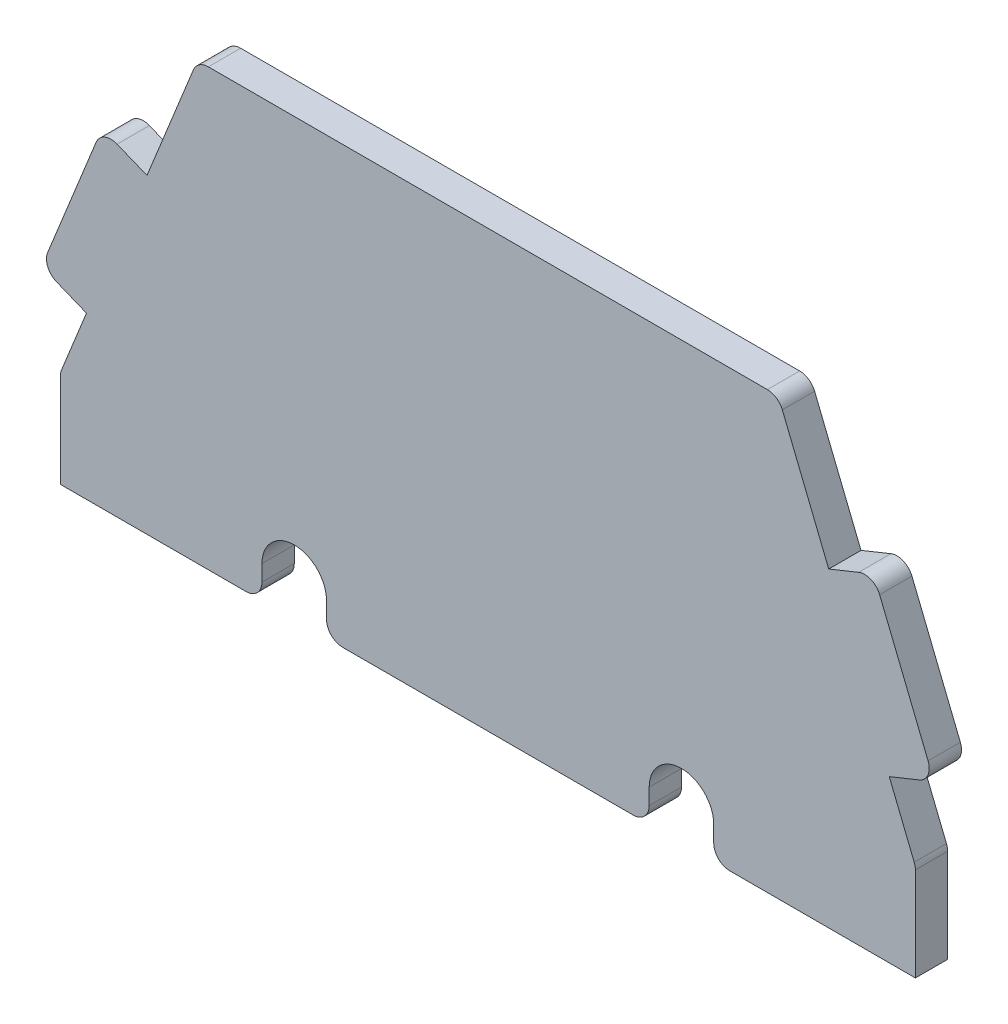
ISO-10303-21;
HEADER;
FILE_DESCRIPTION(('STEP AP214'),'2;1');
FILE_NAME('part.step','',(''),(''),'','','');
FILE_SCHEMA(('AUTOMOTIVE_DESIGN { 1 0 10303 214 1 1 1 1 }'));
ENDSEC;
DATA;
#1=APPLICATION_CONTEXT('core data for automotive mechanical design processes');
#2=APPLICATION_PROTOCOL_DEFINITION('international standard','automotive_design',2000,#1);
#3=PRODUCT_CONTEXT('',#1,'mechanical');
#4=PRODUCT('Part','Part','',(#3));
#5=PRODUCT_RELATED_PRODUCT_CATEGORY('part','',(#4));
#6=PRODUCT_DEFINITION_FORMATION('','',#4);
#7=PRODUCT_DEFINITION_CONTEXT('part definition',#1,'design');
#8=PRODUCT_DEFINITION('design','',#6,#7);
#9=PRODUCT_DEFINITION_SHAPE('','',#8);
#10=(LENGTH_UNIT() NAMED_UNIT(*) SI_UNIT(.MILLI.,.METRE.));
#11=(NAMED_UNIT(*) PLANE_ANGLE_UNIT() SI_UNIT($,.RADIAN.));
#12=(NAMED_UNIT(*) SI_UNIT($,.STERADIAN.) SOLID_ANGLE_UNIT());
#13=UNCERTAINTY_MEASURE_WITH_UNIT(LENGTH_MEASURE(1.E-05),#10,'distance_accuracy_value','');
#14=(GEOMETRIC_REPRESENTATION_CONTEXT(3) GLOBAL_UNCERTAINTY_ASSIGNED_CONTEXT((#13)) GLOBAL_UNIT_ASSIGNED_CONTEXT((#10,
#11,#12)) REPRESENTATION_CONTEXT('',''));
#15=CARTESIAN_POINT('',(0.,0.,0.));
#16=DIRECTION('',(0.,0.,1.));
#17=DIRECTION('',(1.,0.,0.));
#18=AXIS2_PLACEMENT_3D('',#15,#16,#17);
#19=CARTESIAN_POINT('',(15.,-13.5,2.));
#20=DIRECTION('',(0.,1.,0.));
#21=DIRECTION('',(-1.,0.,0.));
#22=AXIS2_PLACEMENT_3D('',#19,#20,#21);
#23=PLANE('',#22);
#24=DIRECTION('',(1.,0.,0.));
#25=VECTOR('',#24,1.);
#26=CARTESIAN_POINT('',(15.,-13.5,0.));
#27=LINE('',#26,#25);
#28=CARTESIAN_POINT('',(15.,-13.5,0.));
#29=VERTEX_POINT('',#28);
#30=CARTESIAN_POINT('',(26.5,-13.5,0.));
#31=VERTEX_POINT('',#30);
#32=EDGE_CURVE('E284',#29,#31,#27,.T.);
#33=ORIENTED_EDGE('',*,*,#32,.T.);
#34=DIRECTION('',(0.,0.,-1.));
#35=VECTOR('',#34,1.);
#36=CARTESIAN_POINT('',(26.5,-13.5,2.));
#37=LINE('',#36,#35);
#38=CARTESIAN_POINT('',(26.5,-13.5,2.));
#39=VERTEX_POINT('',#38);
#40=EDGE_CURVE('E11',#39,#31,#37,.T.);
#41=ORIENTED_EDGE('',*,*,#40,.F.);
#42=DIRECTION('',(1.,0.,0.));
#43=VECTOR('',#42,1.);
#44=CARTESIAN_POINT('',(15.,-13.5,2.));
#45=LINE('',#44,#43);
#46=CARTESIAN_POINT('',(15.,-13.5,2.));
#47=VERTEX_POINT('',#46);
#48=EDGE_CURVE('E350',#47,#39,#45,.T.);
#49=ORIENTED_EDGE('',*,*,#48,.F.);
#50=DIRECTION('',(0.,0.,-1.));
#51=VECTOR('',#50,1.);
#52=CARTESIAN_POINT('',(15.,-13.5,2.));
#53=LINE('',#52,#51);
#54=EDGE_CURVE('E280',#47,#29,#53,.T.);
#55=ORIENTED_EDGE('',*,*,#54,.T.);
#56=EDGE_LOOP('',(#33,#41,#49,#55));
#57=FACE_BOUND('',#56,.T.);
#58=ADVANCED_FACE('F32',(#57),#23,.F.);
#59=CARTESIAN_POINT('',(26.5,-7.69470841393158,2.));
#60=DIRECTION('',(-1.,0.,0.));
#61=DIRECTION('',(0.,-1.,0.));
#62=AXIS2_PLACEMENT_3D('',#59,#60,#61);
#63=PLANE('',#62);
#64=DIRECTION('',(0.,1.,0.));
#65=VECTOR('',#64,1.);
#66=CARTESIAN_POINT('',(26.5,-7.69470841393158,0.));
#67=LINE('',#66,#65);
#68=CARTESIAN_POINT('',(26.5,-7.69470841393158,0.));
#69=VERTEX_POINT('',#68);
#70=EDGE_CURVE('E287',#31,#69,#67,.T.);
#71=ORIENTED_EDGE('',*,*,#70,.T.);
#72=DIRECTION('',(0.,0.,-1.));
#73=VECTOR('',#72,1.);
#74=CARTESIAN_POINT('',(26.5,-7.69470841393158,2.));
#75=LINE('',#74,#73);
#76=CARTESIAN_POINT('',(26.5,-7.69470841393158,2.));
#77=VERTEX_POINT('',#76);
#78=EDGE_CURVE('E40',#77,#69,#75,.T.);
#79=ORIENTED_EDGE('',*,*,#78,.F.);
#80=DIRECTION('',(0.,1.,0.));
#81=VECTOR('',#80,1.);
#82=CARTESIAN_POINT('',(26.5,-7.69470841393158,2.));
#83=LINE('',#82,#81);
#84=EDGE_CURVE('E169',#39,#77,#83,.T.);
#85=ORIENTED_EDGE('',*,*,#84,.F.);
#86=ORIENTED_EDGE('',*,*,#40,.T.);
#87=EDGE_LOOP('',(#71,#79,#85,#86));
#88=FACE_BOUND('',#87,.T.);
#89=ADVANCED_FACE('F538',(#88),#63,.F.);
#90=CARTESIAN_POINT('',(25.5,-7.69470841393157,2.));
#91=DIRECTION('',(0.,0.,-1.));
#92=DIRECTION('',(-1.,0.,0.));
#93=AXIS2_PLACEMENT_3D('',#90,#91,#92);
#94=CYLINDRICAL_SURFACE('',#93,1.);
#95=CARTESIAN_POINT('',(25.5,-7.69470841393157,0.));
#96=DIRECTION('',(0.,0.,1.));
#97=DIRECTION('',(-1.,0.,0.));
#98=AXIS2_PLACEMENT_3D('',#95,#96,#97);
#99=CIRCLE('',#98,1.);
#100=CARTESIAN_POINT('',(26.4269468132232,-7.3195156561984,0.));
#101=VERTEX_POINT('',#100);
#102=EDGE_CURVE('E289',#69,#101,#99,.T.);
#103=ORIENTED_EDGE('',*,*,#102,.T.);
#104=DIRECTION('',(0.,0.,-1.));
#105=VECTOR('',#104,1.);
#106=CARTESIAN_POINT('',(26.4269468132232,-7.3195156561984,2.));
#107=LINE('',#106,#105);
#108=CARTESIAN_POINT('',(26.4269468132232,-7.3195156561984,2.));
#109=VERTEX_POINT('',#108);
#110=EDGE_CURVE('E435',#109,#101,#107,.T.);
#111=ORIENTED_EDGE('',*,*,#110,.F.);
#112=CARTESIAN_POINT('',(25.5,-7.69470841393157,2.));
#113=DIRECTION('',(0.,0.,1.));
#114=DIRECTION('',(-1.,0.,0.));
#115=AXIS2_PLACEMENT_3D('',#112,#113,#114);
#116=CIRCLE('',#115,1.);
#117=EDGE_CURVE('E443',#77,#109,#116,.T.);
#118=ORIENTED_EDGE('',*,*,#117,.F.);
#119=ORIENTED_EDGE('',*,*,#78,.T.);
#120=EDGE_LOOP('',(#103,#111,#118,#119));
#121=FACE_BOUND('',#120,.T.);
#122=ADVANCED_FACE('F441',(#121),#94,.T.);
#123=CARTESIAN_POINT('',(26.4269468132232,-7.3195156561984,2.));
#124=DIRECTION('',(-0.926946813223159,-0.375192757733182,0.));
#125=DIRECTION('',(0.375192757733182,-0.926946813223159,0.));
#126=AXIS2_PLACEMENT_3D('',#123,#124,#125);
#127=PLANE('',#126);
#128=DIRECTION('',(-0.375192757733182,0.926946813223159,0.));
#129=VECTOR('',#128,1.);
#130=CARTESIAN_POINT('',(26.4269468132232,-7.3195156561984,0.));
#131=LINE('',#130,#129);
#132=CARTESIAN_POINT('',(24.8809523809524,-3.5,0.));
#133=VERTEX_POINT('',#132);
#134=EDGE_CURVE('E291',#101,#133,#131,.T.);
#135=ORIENTED_EDGE('',*,*,#134,.T.);
#136=DIRECTION('',(0.,0.,-1.));
#137=VECTOR('',#136,1.);
#138=CARTESIAN_POINT('',(24.8809523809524,-3.5,2.));
#139=LINE('',#138,#137);
#140=CARTESIAN_POINT('',(24.8809523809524,-3.5,2.));
#141=VERTEX_POINT('',#140);
#142=EDGE_CURVE('E432',#141,#133,#139,.T.);
#143=ORIENTED_EDGE('',*,*,#142,.F.);
#144=DIRECTION('',(-0.375192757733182,0.926946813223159,0.));
#145=VECTOR('',#144,1.);
#146=CARTESIAN_POINT('',(26.4269468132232,-7.3195156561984,2.));
#147=LINE('',#146,#145);
#148=EDGE_CURVE('E461',#109,#141,#147,.T.);
#149=ORIENTED_EDGE('',*,*,#148,.F.);
#150=ORIENTED_EDGE('',*,*,#110,.T.);
#151=EDGE_LOOP('',(#135,#143,#149,#150));
#152=FACE_BOUND('',#151,.T.);
#153=ADVANCED_FACE('F452',(#152),#127,.F.);
#154=CARTESIAN_POINT('',(24.8809523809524,-3.5,2.));
#155=DIRECTION('',(-0.375192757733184,0.926946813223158,0.));
#156=DIRECTION('',(-0.926946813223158,-0.375192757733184,0.));
#157=AXIS2_PLACEMENT_3D('',#154,#155,#156);
#158=PLANE('',#157);
#159=DIRECTION('',(0.926946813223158,0.375192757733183,0.));
#160=VECTOR('',#159,1.);
#161=CARTESIAN_POINT('',(24.8809523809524,-3.5,0.));
#162=LINE('',#161,#160);
#163=CARTESIAN_POINT('',(26.7348460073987,-2.74961448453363,0.));
#164=VERTEX_POINT('',#163);
#165=EDGE_CURVE('E293',#133,#164,#162,.T.);
#166=ORIENTED_EDGE('',*,*,#165,.T.);
#167=DIRECTION('',(0.,0.,-1.));
#168=VECTOR('',#167,1.);
#169=CARTESIAN_POINT('',(26.7348460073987,-2.74961448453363,2.));
#170=LINE('',#169,#168);
#171=CARTESIAN_POINT('',(26.7348460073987,-2.74961448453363,2.));
#172=VERTEX_POINT('',#171);
#173=EDGE_CURVE('E429',#172,#164,#170,.T.);
#174=ORIENTED_EDGE('',*,*,#173,.F.);
#175=DIRECTION('',(0.926946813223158,0.375192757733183,0.));
#176=VECTOR('',#175,1.);
#177=CARTESIAN_POINT('',(24.8809523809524,-3.5,2.));
#178=LINE('',#177,#176);
#179=EDGE_CURVE('E458',#141,#172,#178,.T.);
#180=ORIENTED_EDGE('',*,*,#179,.F.);
#181=ORIENTED_EDGE('',*,*,#142,.T.);
#182=EDGE_LOOP('',(#166,#174,#180,#181));
#183=FACE_BOUND('',#182,.T.);
#184=ADVANCED_FACE('F456',(#183),#158,.F.);
#185=CARTESIAN_POINT('',(26.3596532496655,-1.82266767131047,2.));
#186=DIRECTION('',(0.,0.,-1.));
#187=DIRECTION('',(-1.,0.,0.));
#188=AXIS2_PLACEMENT_3D('',#185,#186,#187);
#189=CYLINDRICAL_SURFACE('',#188,0.999999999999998);
#190=CARTESIAN_POINT('',(26.3596532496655,-1.82266767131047,0.));
#191=DIRECTION('',(0.,0.,1.));
#192=DIRECTION('',(1.,0.,0.));
#193=AXIS2_PLACEMENT_3D('',#190,#191,#192);
#194=CIRCLE('',#193,0.999999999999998);
#195=CARTESIAN_POINT('',(27.2866000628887,-1.44747491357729,0.));
#196=VERTEX_POINT('',#195);
#197=EDGE_CURVE('E295',#164,#196,#194,.T.);
#198=ORIENTED_EDGE('',*,*,#197,.T.);
#199=DIRECTION('',(0.,0.,-1.));
#200=VECTOR('',#199,1.);
#201=CARTESIAN_POINT('',(27.2866000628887,-1.44747491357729,2.));
#202=LINE('',#201,#200);
#203=CARTESIAN_POINT('',(27.2866000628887,-1.44747491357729,2.));
#204=VERTEX_POINT('',#203);
#205=EDGE_CURVE('E426',#204,#196,#202,.T.);
#206=ORIENTED_EDGE('',*,*,#205,.F.);
#207=CARTESIAN_POINT('',(26.3596532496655,-1.82266767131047,2.));
#208=DIRECTION('',(0.,0.,1.));
#209=DIRECTION('',(1.,0.,0.));
#210=AXIS2_PLACEMENT_3D('',#207,#208,#209);
#211=CIRCLE('',#210,0.999999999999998);
#212=EDGE_CURVE('E460',#172,#204,#211,.T.);
#213=ORIENTED_EDGE('',*,*,#212,.F.);
#214=ORIENTED_EDGE('',*,*,#173,.T.);
#215=EDGE_LOOP('',(#198,#206,#213,#214));
#216=FACE_BOUND('',#215,.T.);
#217=ADVANCED_FACE('F551',(#216),#189,.T.);
#218=CARTESIAN_POINT('',(27.2866000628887,-1.44747491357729,2.));
#219=DIRECTION('',(-0.926946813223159,-0.375192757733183,0.));
#220=DIRECTION('',(0.375192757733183,-0.926946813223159,0.));
#221=AXIS2_PLACEMENT_3D('',#218,#219,#220);
#222=PLANE('',#221);
#223=DIRECTION('',(-0.375192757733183,0.926946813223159,0.));
#224=VECTOR('',#223,1.);
#225=CARTESIAN_POINT('',(27.2866000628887,-1.44747491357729,0.));
#226=LINE('',#225,#224);
#227=CARTESIAN_POINT('',(24.2850580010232,5.96809959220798,0.));
#228=VERTEX_POINT('',#227);
#229=EDGE_CURVE('E297',#196,#228,#226,.T.);
#230=ORIENTED_EDGE('',*,*,#229,.T.);
#231=DIRECTION('',(0.,0.,-1.));
#232=VECTOR('',#231,1.);
#233=CARTESIAN_POINT('',(24.2850580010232,5.96809959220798,2.));
#234=LINE('',#233,#232);
#235=CARTESIAN_POINT('',(24.2850580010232,5.96809959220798,2.));
#236=VERTEX_POINT('',#235);
#237=EDGE_CURVE('E423',#236,#228,#234,.T.);
#238=ORIENTED_EDGE('',*,*,#237,.F.);
#239=DIRECTION('',(-0.375192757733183,0.926946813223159,0.));
#240=VECTOR('',#239,1.);
#241=CARTESIAN_POINT('',(27.2866000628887,-1.44747491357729,2.));
#242=LINE('',#241,#240);
#243=EDGE_CURVE('E463',#204,#236,#242,.T.);
#244=ORIENTED_EDGE('',*,*,#243,.F.);
#245=ORIENTED_EDGE('',*,*,#205,.T.);
#246=EDGE_LOOP('',(#230,#238,#244,#245));
#247=FACE_BOUND('',#246,.T.);
#248=ADVANCED_FACE('F554',(#247),#222,.F.);
#249=CARTESIAN_POINT('',(23.3581111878,5.5929068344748,2.));
#250=DIRECTION('',(0.,0.,-1.));
#251=DIRECTION('',(-1.,0.,0.));
#252=AXIS2_PLACEMENT_3D('',#249,#250,#251);
#253=CYLINDRICAL_SURFACE('',#252,1.);
#254=CARTESIAN_POINT('',(23.3581111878,5.5929068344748,0.));
#255=DIRECTION('',(0.,0.,1.));
#256=DIRECTION('',(-1.,0.,0.));
#257=AXIS2_PLACEMENT_3D('',#254,#255,#256);
#258=CIRCLE('',#257,1.);
#259=CARTESIAN_POINT('',(22.9829184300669,6.51985364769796,0.));
#260=VERTEX_POINT('',#259);
#261=EDGE_CURVE('E299',#228,#260,#258,.T.);
#262=ORIENTED_EDGE('',*,*,#261,.T.);
#263=DIRECTION('',(0.,0.,-1.));
#264=VECTOR('',#263,1.);
#265=CARTESIAN_POINT('',(22.9829184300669,6.51985364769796,2.));
#266=LINE('',#265,#264);
#267=CARTESIAN_POINT('',(22.9829184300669,6.51985364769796,2.));
#268=VERTEX_POINT('',#267);
#269=EDGE_CURVE('E420',#268,#260,#266,.T.);
#270=ORIENTED_EDGE('',*,*,#269,.F.);
#271=CARTESIAN_POINT('',(23.3581111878,5.5929068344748,2.));
#272=DIRECTION('',(0.,0.,1.));
#273=DIRECTION('',(-1.,0.,0.));
#274=AXIS2_PLACEMENT_3D('',#271,#272,#273);
#275=CIRCLE('',#274,1.);
#276=EDGE_CURVE('E469',#236,#268,#275,.T.);
#277=ORIENTED_EDGE('',*,*,#276,.F.);
#278=ORIENTED_EDGE('',*,*,#237,.T.);
#279=EDGE_LOOP('',(#262,#270,#277,#278));
#280=FACE_BOUND('',#279,.T.);
#281=ADVANCED_FACE('F558',(#280),#253,.T.);
#282=CARTESIAN_POINT('',(21.1290248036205,5.76946813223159,2.));
#283=DIRECTION('',(0.375192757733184,-0.926946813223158,0.));
#284=DIRECTION('',(0.926946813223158,0.375192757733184,0.));
#285=AXIS2_PLACEMENT_3D('',#282,#283,#284);
#286=PLANE('',#285);
#287=DIRECTION('',(-0.926946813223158,-0.375192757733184,0.));
#288=VECTOR('',#287,1.);
#289=CARTESIAN_POINT('',(21.1290248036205,5.76946813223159,0.));
#290=LINE('',#289,#288);
#291=CARTESIAN_POINT('',(21.1290248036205,5.76946813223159,0.));
#292=VERTEX_POINT('',#291);
#293=EDGE_CURVE('E301',#260,#292,#290,.T.);
#294=ORIENTED_EDGE('',*,*,#293,.T.);
#295=DIRECTION('',(0.,0.,-1.));
#296=VECTOR('',#295,1.);
#297=CARTESIAN_POINT('',(21.1290248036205,5.76946813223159,2.));
#298=LINE('',#297,#296);
#299=CARTESIAN_POINT('',(21.1290248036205,5.76946813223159,2.));
#300=VERTEX_POINT('',#299);
#301=EDGE_CURVE('E417',#300,#292,#298,.T.);
#302=ORIENTED_EDGE('',*,*,#301,.F.);
#303=DIRECTION('',(-0.926946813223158,-0.375192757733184,0.));
#304=VECTOR('',#303,1.);
#305=CARTESIAN_POINT('',(21.1290248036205,5.76946813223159,2.));
#306=LINE('',#305,#304);
#307=EDGE_CURVE('E471',#268,#300,#306,.T.);
#308=ORIENTED_EDGE('',*,*,#307,.F.);
#309=ORIENTED_EDGE('',*,*,#269,.T.);
#310=EDGE_LOOP('',(#294,#302,#308,#309));
#311=FACE_BOUND('',#310,.T.);
#312=ADVANCED_FACE('F562',(#311),#286,.F.);
#313=CARTESIAN_POINT('',(21.1290248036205,5.76946813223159,2.));
#314=DIRECTION('',(-0.926946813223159,-0.375192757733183,0.));
#315=DIRECTION('',(0.375192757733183,-0.926946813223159,0.));
#316=AXIS2_PLACEMENT_3D('',#313,#314,#315);
#317=PLANE('',#316);
#318=DIRECTION('',(-0.375192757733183,0.926946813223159,0.));
#319=VECTOR('',#318,1.);
#320=CARTESIAN_POINT('',(21.1290248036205,5.76946813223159,0.));
#321=LINE('',#320,#319);
#322=CARTESIAN_POINT('',(18.252898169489,12.8751927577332,0.));
#323=VERTEX_POINT('',#322);
#324=EDGE_CURVE('E303',#292,#323,#321,.T.);
#325=ORIENTED_EDGE('',*,*,#324,.T.);
#326=DIRECTION('',(0.,0.,-1.));
#327=VECTOR('',#326,1.);
#328=CARTESIAN_POINT('',(18.252898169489,12.8751927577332,2.));
#329=LINE('',#328,#327);
#330=CARTESIAN_POINT('',(18.252898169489,12.8751927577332,2.));
#331=VERTEX_POINT('',#330);
#332=EDGE_CURVE('E414',#331,#323,#329,.T.);
#333=ORIENTED_EDGE('',*,*,#332,.F.);
#334=DIRECTION('',(-0.375192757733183,0.926946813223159,0.));
#335=VECTOR('',#334,1.);
#336=CARTESIAN_POINT('',(21.1290248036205,5.76946813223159,2.));
#337=LINE('',#336,#335);
#338=EDGE_CURVE('E473',#300,#331,#337,.T.);
#339=ORIENTED_EDGE('',*,*,#338,.F.);
#340=ORIENTED_EDGE('',*,*,#301,.T.);
#341=EDGE_LOOP('',(#325,#333,#339,#340));
#342=FACE_BOUND('',#341,.T.);
#343=ADVANCED_FACE('F566',(#342),#317,.F.);
#344=CARTESIAN_POINT('',(17.3259513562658,12.5,2.));
#345=DIRECTION('',(0.,0.,-1.));
#346=DIRECTION('',(-1.,0.,0.));
#347=AXIS2_PLACEMENT_3D('',#344,#345,#346);
#348=CYLINDRICAL_SURFACE('',#347,0.999999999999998);
#349=CARTESIAN_POINT('',(17.3259513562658,12.5,0.));
#350=DIRECTION('',(0.,0.,1.));
#351=DIRECTION('',(1.,0.,0.));
#352=AXIS2_PLACEMENT_3D('',#349,#350,#351);
#353=CIRCLE('',#352,0.999999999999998);
#354=CARTESIAN_POINT('',(17.3259513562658,13.5,0.));
#355=VERTEX_POINT('',#354);
#356=EDGE_CURVE('E305',#323,#355,#353,.T.);
#357=ORIENTED_EDGE('',*,*,#356,.T.);
#358=DIRECTION('',(0.,0.,-1.));
#359=VECTOR('',#358,1.);
#360=CARTESIAN_POINT('',(17.3259513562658,13.5,2.));
#361=LINE('',#360,#359);
#362=CARTESIAN_POINT('',(17.3259513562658,13.5,2.));
#363=VERTEX_POINT('',#362);
#364=EDGE_CURVE('E411',#363,#355,#361,.T.);
#365=ORIENTED_EDGE('',*,*,#364,.F.);
#366=CARTESIAN_POINT('',(17.3259513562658,12.5,2.));
#367=DIRECTION('',(0.,0.,1.));
#368=DIRECTION('',(1.,0.,0.));
#369=AXIS2_PLACEMENT_3D('',#366,#367,#368);
#370=CIRCLE('',#369,0.999999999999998);
#371=EDGE_CURVE('E475',#331,#363,#370,.T.);
#372=ORIENTED_EDGE('',*,*,#371,.F.);
#373=ORIENTED_EDGE('',*,*,#332,.T.);
#374=EDGE_LOOP('',(#357,#365,#372,#373));
#375=FACE_BOUND('',#374,.T.);
#376=ADVANCED_FACE('F570',(#375),#348,.T.);
#377=CARTESIAN_POINT('',(-17.3259513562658,13.5,2.));
#378=DIRECTION('',(0.,-1.,0.));
#379=DIRECTION('',(1.,0.,0.));
#380=AXIS2_PLACEMENT_3D('',#377,#378,#379);
#381=PLANE('',#380);
#382=DIRECTION('',(-1.,0.,0.));
#383=VECTOR('',#382,1.);
#384=CARTESIAN_POINT('',(-17.3259513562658,13.5,0.));
#385=LINE('',#384,#383);
#386=CARTESIAN_POINT('',(-17.3259513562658,13.5,0.));
#387=VERTEX_POINT('',#386);
#388=EDGE_CURVE('E307',#355,#387,#385,.T.);
#389=ORIENTED_EDGE('',*,*,#388,.T.);
#390=DIRECTION('',(0.,0.,-1.));
#391=VECTOR('',#390,1.);
#392=CARTESIAN_POINT('',(-17.3259513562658,13.5,2.));
#393=LINE('',#392,#391);
#394=CARTESIAN_POINT('',(-17.3259513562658,13.5,2.));
#395=VERTEX_POINT('',#394);
#396=EDGE_CURVE('E408',#395,#387,#393,.T.);
#397=ORIENTED_EDGE('',*,*,#396,.F.);
#398=DIRECTION('',(-1.,0.,0.));
#399=VECTOR('',#398,1.);
#400=CARTESIAN_POINT('',(-17.3259513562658,13.5,2.));
#401=LINE('',#400,#399);
#402=EDGE_CURVE('E477',#363,#395,#401,.T.);
#403=ORIENTED_EDGE('',*,*,#402,.F.);
#404=ORIENTED_EDGE('',*,*,#364,.T.);
#405=EDGE_LOOP('',(#389,#397,#403,#404));
#406=FACE_BOUND('',#405,.T.);
#407=ADVANCED_FACE('F574',(#406),#381,.F.);
#408=CARTESIAN_POINT('',(-17.3259513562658,12.5,2.));
#409=DIRECTION('',(0.,0.,-1.));
#410=DIRECTION('',(-1.,0.,0.));
#411=AXIS2_PLACEMENT_3D('',#408,#409,#410);
#412=CYLINDRICAL_SURFACE('',#411,0.999999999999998);
#413=CARTESIAN_POINT('',(-17.3259513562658,12.5,0.));
#414=DIRECTION('',(0.,0.,1.));
#415=DIRECTION('',(-1.,0.,0.));
#416=AXIS2_PLACEMENT_3D('',#413,#414,#415);
#417=CIRCLE('',#416,0.999999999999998);
#418=CARTESIAN_POINT('',(-18.252898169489,12.8751927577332,0.));
#419=VERTEX_POINT('',#418);
#420=EDGE_CURVE('E309',#387,#419,#417,.T.);
#421=ORIENTED_EDGE('',*,*,#420,.T.);
#422=DIRECTION('',(0.,0.,-1.));
#423=VECTOR('',#422,1.);
#424=CARTESIAN_POINT('',(-18.252898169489,12.8751927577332,2.));
#425=LINE('',#424,#423);
#426=CARTESIAN_POINT('',(-18.252898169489,12.8751927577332,2.));
#427=VERTEX_POINT('',#426);
#428=EDGE_CURVE('E405',#427,#419,#425,.T.);
#429=ORIENTED_EDGE('',*,*,#428,.F.);
#430=CARTESIAN_POINT('',(-17.3259513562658,12.5,2.));
#431=DIRECTION('',(0.,0.,1.));
#432=DIRECTION('',(-1.,0.,0.));
#433=AXIS2_PLACEMENT_3D('',#430,#431,#432);
#434=CIRCLE('',#433,0.999999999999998);
#435=EDGE_CURVE('E479',#395,#427,#434,.T.);
#436=ORIENTED_EDGE('',*,*,#435,.F.);
#437=ORIENTED_EDGE('',*,*,#396,.T.);
#438=EDGE_LOOP('',(#421,#429,#436,#437));
#439=FACE_BOUND('',#438,.T.);
#440=ADVANCED_FACE('F578',(#439),#412,.T.);
#441=CARTESIAN_POINT('',(-21.1290248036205,5.76946813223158,2.));
#442=DIRECTION('',(0.926946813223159,-0.375192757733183,0.));
#443=DIRECTION('',(0.375192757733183,0.926946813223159,0.));
#444=AXIS2_PLACEMENT_3D('',#441,#442,#443);
#445=PLANE('',#444);
#446=DIRECTION('',(-0.375192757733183,-0.926946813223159,0.));
#447=VECTOR('',#446,1.);
#448=CARTESIAN_POINT('',(-21.1290248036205,5.76946813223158,0.));
#449=LINE('',#448,#447);
#450=CARTESIAN_POINT('',(-21.1290248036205,5.76946813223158,0.));
#451=VERTEX_POINT('',#450);
#452=EDGE_CURVE('E311',#419,#451,#449,.T.);
#453=ORIENTED_EDGE('',*,*,#452,.T.);
#454=DIRECTION('',(0.,0.,-1.));
#455=VECTOR('',#454,1.);
#456=CARTESIAN_POINT('',(-21.1290248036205,5.76946813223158,2.));
#457=LINE('',#456,#455);
#458=CARTESIAN_POINT('',(-21.1290248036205,5.76946813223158,2.));
#459=VERTEX_POINT('',#458);
#460=EDGE_CURVE('E402',#459,#451,#457,.T.);
#461=ORIENTED_EDGE('',*,*,#460,.F.);
#462=DIRECTION('',(-0.375192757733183,-0.926946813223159,0.));
#463=VECTOR('',#462,1.);
#464=CARTESIAN_POINT('',(-21.1290248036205,5.76946813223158,2.));
#465=LINE('',#464,#463);
#466=EDGE_CURVE('E481',#427,#459,#465,.T.);
#467=ORIENTED_EDGE('',*,*,#466,.F.);
#468=ORIENTED_EDGE('',*,*,#428,.T.);
#469=EDGE_LOOP('',(#453,#461,#467,#468));
#470=FACE_BOUND('',#469,.T.);
#471=ADVANCED_FACE('F582',(#470),#445,.F.);
#472=CARTESIAN_POINT('',(-21.1290248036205,5.76946813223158,2.));
#473=DIRECTION('',(-0.375192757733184,-0.926946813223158,0.));
#474=DIRECTION('',(0.926946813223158,-0.375192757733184,0.));
#475=AXIS2_PLACEMENT_3D('',#472,#473,#474);
#476=PLANE('',#475);
#477=DIRECTION('',(-0.926946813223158,0.375192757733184,0.));
#478=VECTOR('',#477,1.);
#479=CARTESIAN_POINT('',(-21.1290248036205,5.76946813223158,0.));
#480=LINE('',#479,#478);
#481=CARTESIAN_POINT('',(-22.9829184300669,6.51985364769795,0.));
#482=VERTEX_POINT('',#481);
#483=EDGE_CURVE('E313',#451,#482,#480,.T.);
#484=ORIENTED_EDGE('',*,*,#483,.T.);
#485=DIRECTION('',(0.,0.,-1.));
#486=VECTOR('',#485,1.);
#487=CARTESIAN_POINT('',(-22.9829184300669,6.51985364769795,2.));
#488=LINE('',#487,#486);
#489=CARTESIAN_POINT('',(-22.9829184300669,6.51985364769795,2.));
#490=VERTEX_POINT('',#489);
#491=EDGE_CURVE('E399',#490,#482,#488,.T.);
#492=ORIENTED_EDGE('',*,*,#491,.F.);
#493=DIRECTION('',(-0.926946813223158,0.375192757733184,0.));
#494=VECTOR('',#493,1.);
#495=CARTESIAN_POINT('',(-21.1290248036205,5.76946813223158,2.));
#496=LINE('',#495,#494);
#497=EDGE_CURVE('E483',#459,#490,#496,.T.);
#498=ORIENTED_EDGE('',*,*,#497,.F.);
#499=ORIENTED_EDGE('',*,*,#460,.T.);
#500=EDGE_LOOP('',(#484,#492,#498,#499));
#501=FACE_BOUND('',#500,.T.);
#502=ADVANCED_FACE('F586',(#501),#476,.F.);
#503=CARTESIAN_POINT('',(-23.3581111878,5.59290683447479,2.));
#504=DIRECTION('',(0.,0.,-1.));
#505=DIRECTION('',(-1.,0.,0.));
#506=AXIS2_PLACEMENT_3D('',#503,#504,#505);
#507=CYLINDRICAL_SURFACE('',#506,1.);
#508=CARTESIAN_POINT('',(-23.3581111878,5.59290683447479,0.));
#509=DIRECTION('',(0.,0.,1.));
#510=DIRECTION('',(1.,0.,0.));
#511=AXIS2_PLACEMENT_3D('',#508,#509,#510);
#512=CIRCLE('',#511,1.);
#513=CARTESIAN_POINT('',(-24.2850580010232,5.96809959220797,0.));
#514=VERTEX_POINT('',#513);
#515=EDGE_CURVE('E315',#482,#514,#512,.T.);
#516=ORIENTED_EDGE('',*,*,#515,.T.);
#517=DIRECTION('',(0.,0.,-1.));
#518=VECTOR('',#517,1.);
#519=CARTESIAN_POINT('',(-24.2850580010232,5.96809959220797,2.));
#520=LINE('',#519,#518);
#521=CARTESIAN_POINT('',(-24.2850580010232,5.96809959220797,2.));
#522=VERTEX_POINT('',#521);
#523=EDGE_CURVE('E396',#522,#514,#520,.T.);
#524=ORIENTED_EDGE('',*,*,#523,.F.);
#525=CARTESIAN_POINT('',(-23.3581111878,5.59290683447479,2.));
#526=DIRECTION('',(0.,0.,1.));
#527=DIRECTION('',(1.,0.,0.));
#528=AXIS2_PLACEMENT_3D('',#525,#526,#527);
#529=CIRCLE('',#528,1.);
#530=EDGE_CURVE('E485',#490,#522,#529,.T.);
#531=ORIENTED_EDGE('',*,*,#530,.F.);
#532=ORIENTED_EDGE('',*,*,#491,.T.);
#533=EDGE_LOOP('',(#516,#524,#531,#532));
#534=FACE_BOUND('',#533,.T.);
#535=ADVANCED_FACE('F590',(#534),#507,.T.);
#536=CARTESIAN_POINT('',(-27.2866000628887,-1.4474749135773,2.));
#537=DIRECTION('',(0.926946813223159,-0.375192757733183,0.));
#538=DIRECTION('',(0.375192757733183,0.926946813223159,0.));
#539=AXIS2_PLACEMENT_3D('',#536,#537,#538);
#540=PLANE('',#539);
#541=DIRECTION('',(-0.375192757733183,-0.926946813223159,0.));
#542=VECTOR('',#541,1.);
#543=CARTESIAN_POINT('',(-27.2866000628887,-1.4474749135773,0.));
#544=LINE('',#543,#542);
#545=CARTESIAN_POINT('',(-27.2866000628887,-1.4474749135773,0.));
#546=VERTEX_POINT('',#545);
#547=EDGE_CURVE('E317',#514,#546,#544,.T.);
#548=ORIENTED_EDGE('',*,*,#547,.T.);
#549=DIRECTION('',(0.,0.,-1.));
#550=VECTOR('',#549,1.);
#551=CARTESIAN_POINT('',(-27.2866000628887,-1.4474749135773,2.));
#552=LINE('',#551,#550);
#553=CARTESIAN_POINT('',(-27.2866000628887,-1.4474749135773,2.));
#554=VERTEX_POINT('',#553);
#555=EDGE_CURVE('E393',#554,#546,#552,.T.);
#556=ORIENTED_EDGE('',*,*,#555,.F.);
#557=DIRECTION('',(-0.375192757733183,-0.926946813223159,0.));
#558=VECTOR('',#557,1.);
#559=CARTESIAN_POINT('',(-27.2866000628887,-1.4474749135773,2.));
#560=LINE('',#559,#558);
#561=EDGE_CURVE('E487',#522,#554,#560,.T.);
#562=ORIENTED_EDGE('',*,*,#561,.F.);
#563=ORIENTED_EDGE('',*,*,#523,.T.);
#564=EDGE_LOOP('',(#548,#556,#562,#563));
#565=FACE_BOUND('',#564,.T.);
#566=ADVANCED_FACE('F594',(#565),#540,.F.);
#567=CARTESIAN_POINT('',(-26.3596532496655,-1.82266767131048,2.));
#568=DIRECTION('',(0.,0.,-1.));
#569=DIRECTION('',(-1.,0.,0.));
#570=AXIS2_PLACEMENT_3D('',#567,#568,#569);
#571=CYLINDRICAL_SURFACE('',#570,0.999999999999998);
#572=CARTESIAN_POINT('',(-26.3596532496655,-1.82266767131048,0.));
#573=DIRECTION('',(0.,0.,1.));
#574=DIRECTION('',(-1.,0.,0.));
#575=AXIS2_PLACEMENT_3D('',#572,#573,#574);
#576=CIRCLE('',#575,0.999999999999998);
#577=CARTESIAN_POINT('',(-26.7348460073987,-2.74961448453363,0.));
#578=VERTEX_POINT('',#577);
#579=EDGE_CURVE('E319',#546,#578,#576,.T.);
#580=ORIENTED_EDGE('',*,*,#579,.T.);
#581=DIRECTION('',(0.,0.,-1.));
#582=VECTOR('',#581,1.);
#583=CARTESIAN_POINT('',(-26.7348460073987,-2.74961448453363,2.));
#584=LINE('',#583,#582);
#585=CARTESIAN_POINT('',(-26.7348460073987,-2.74961448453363,2.));
#586=VERTEX_POINT('',#585);
#587=EDGE_CURVE('E390',#586,#578,#584,.T.);
#588=ORIENTED_EDGE('',*,*,#587,.F.);
#589=CARTESIAN_POINT('',(-26.3596532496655,-1.82266767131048,2.));
#590=DIRECTION('',(0.,0.,1.));
#591=DIRECTION('',(-1.,0.,0.));
#592=AXIS2_PLACEMENT_3D('',#589,#590,#591);
#593=CIRCLE('',#592,0.999999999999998);
#594=EDGE_CURVE('E489',#554,#586,#593,.T.);
#595=ORIENTED_EDGE('',*,*,#594,.F.);
#596=ORIENTED_EDGE('',*,*,#555,.T.);
#597=EDGE_LOOP('',(#580,#588,#595,#596));
#598=FACE_BOUND('',#597,.T.);
#599=ADVANCED_FACE('F598',(#598),#571,.T.);
#600=CARTESIAN_POINT('',(-24.8809523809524,-3.5,2.));
#601=DIRECTION('',(0.375192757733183,0.926946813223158,0.));
#602=DIRECTION('',(-0.926946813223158,0.375192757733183,0.));
#603=AXIS2_PLACEMENT_3D('',#600,#601,#602);
#604=PLANE('',#603);
#605=DIRECTION('',(0.926946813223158,-0.375192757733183,0.));
#606=VECTOR('',#605,1.);
#607=CARTESIAN_POINT('',(-24.8809523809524,-3.5,0.));
#608=LINE('',#607,#606);
#609=CARTESIAN_POINT('',(-24.8809523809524,-3.5,0.));
#610=VERTEX_POINT('',#609);
#611=EDGE_CURVE('E321',#578,#610,#608,.T.);
#612=ORIENTED_EDGE('',*,*,#611,.T.);
#613=DIRECTION('',(0.,0.,-1.));
#614=VECTOR('',#613,1.);
#615=CARTESIAN_POINT('',(-24.8809523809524,-3.5,2.));
#616=LINE('',#615,#614);
#617=CARTESIAN_POINT('',(-24.8809523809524,-3.5,2.));
#618=VERTEX_POINT('',#617);
#619=EDGE_CURVE('E387',#618,#610,#616,.T.);
#620=ORIENTED_EDGE('',*,*,#619,.F.);
#621=DIRECTION('',(0.926946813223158,-0.375192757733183,0.));
#622=VECTOR('',#621,1.);
#623=CARTESIAN_POINT('',(-24.8809523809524,-3.5,2.));
#624=LINE('',#623,#622);
#625=EDGE_CURVE('E491',#586,#618,#624,.T.);
#626=ORIENTED_EDGE('',*,*,#625,.F.);
#627=ORIENTED_EDGE('',*,*,#587,.T.);
#628=EDGE_LOOP('',(#612,#620,#626,#627));
#629=FACE_BOUND('',#628,.T.);
#630=ADVANCED_FACE('F602',(#629),#604,.F.);
#631=CARTESIAN_POINT('',(-26.4269468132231,-7.31951565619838,2.));
#632=DIRECTION('',(0.926946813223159,-0.375192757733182,0.));
#633=DIRECTION('',(0.375192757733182,0.926946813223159,0.));
#634=AXIS2_PLACEMENT_3D('',#631,#632,#633);
#635=PLANE('',#634);
#636=DIRECTION('',(-0.375192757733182,-0.926946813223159,0.));
#637=VECTOR('',#636,1.);
#638=CARTESIAN_POINT('',(-26.4269468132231,-7.31951565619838,0.));
#639=LINE('',#638,#637);
#640=CARTESIAN_POINT('',(-26.4269468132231,-7.31951565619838,0.));
#641=VERTEX_POINT('',#640);
#642=EDGE_CURVE('E323',#610,#641,#639,.T.);
#643=ORIENTED_EDGE('',*,*,#642,.T.);
#644=DIRECTION('',(0.,0.,-1.));
#645=VECTOR('',#644,1.);
#646=CARTESIAN_POINT('',(-26.4269468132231,-7.31951565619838,2.));
#647=LINE('',#646,#645);
#648=CARTESIAN_POINT('',(-26.4269468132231,-7.31951565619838,2.));
#649=VERTEX_POINT('',#648);
#650=EDGE_CURVE('E384',#649,#641,#647,.T.);
#651=ORIENTED_EDGE('',*,*,#650,.F.);
#652=DIRECTION('',(-0.375192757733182,-0.926946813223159,0.));
#653=VECTOR('',#652,1.);
#654=CARTESIAN_POINT('',(-26.4269468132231,-7.31951565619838,2.));
#655=LINE('',#654,#653);
#656=EDGE_CURVE('E493',#618,#649,#655,.T.);
#657=ORIENTED_EDGE('',*,*,#656,.F.);
#658=ORIENTED_EDGE('',*,*,#619,.T.);
#659=EDGE_LOOP('',(#643,#651,#657,#658));
#660=FACE_BOUND('',#659,.T.);
#661=ADVANCED_FACE('F606',(#660),#635,.F.);
#662=CARTESIAN_POINT('',(-25.5,-7.69470841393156,2.));
#663=DIRECTION('',(0.,0.,-1.));
#664=DIRECTION('',(-1.,0.,0.));
#665=AXIS2_PLACEMENT_3D('',#662,#663,#664);
#666=CYLINDRICAL_SURFACE('',#665,1.);
#667=CARTESIAN_POINT('',(-25.5,-7.69470841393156,0.));
#668=DIRECTION('',(0.,0.,1.));
#669=DIRECTION('',(1.,0.,0.));
#670=AXIS2_PLACEMENT_3D('',#667,#668,#669);
#671=CIRCLE('',#670,1.);
#672=CARTESIAN_POINT('',(-26.5,-7.69470841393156,0.));
#673=VERTEX_POINT('',#672);
#674=EDGE_CURVE('E325',#641,#673,#671,.T.);
#675=ORIENTED_EDGE('',*,*,#674,.T.);
#676=DIRECTION('',(0.,0.,-1.));
#677=VECTOR('',#676,1.);
#678=CARTESIAN_POINT('',(-26.5,-7.69470841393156,2.));
#679=LINE('',#678,#677);
#680=CARTESIAN_POINT('',(-26.5,-7.69470841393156,2.));
#681=VERTEX_POINT('',#680);
#682=EDGE_CURVE('E381',#681,#673,#679,.T.);
#683=ORIENTED_EDGE('',*,*,#682,.F.);
#684=CARTESIAN_POINT('',(-25.5,-7.69470841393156,2.));
#685=DIRECTION('',(0.,0.,1.));
#686=DIRECTION('',(1.,0.,0.));
#687=AXIS2_PLACEMENT_3D('',#684,#685,#686);
#688=CIRCLE('',#687,1.);
#689=EDGE_CURVE('E495',#649,#681,#688,.T.);
#690=ORIENTED_EDGE('',*,*,#689,.F.);
#691=ORIENTED_EDGE('',*,*,#650,.T.);
#692=EDGE_LOOP('',(#675,#683,#690,#691));
#693=FACE_BOUND('',#692,.T.);
#694=ADVANCED_FACE('F610',(#693),#666,.T.);
#695=CARTESIAN_POINT('',(-26.5,-7.69470841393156,2.));
#696=DIRECTION('',(1.,0.,0.));
#697=DIRECTION('',(0.,0.,-1.));
#698=AXIS2_PLACEMENT_3D('',#695,#696,#697);
#699=PLANE('',#698);
#700=DIRECTION('',(0.,-1.,0.));
#701=VECTOR('',#700,1.);
#702=CARTESIAN_POINT('',(-26.5,-7.69470841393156,0.));
#703=LINE('',#702,#701);
#704=CARTESIAN_POINT('',(-26.5,-13.5,0.));
#705=VERTEX_POINT('',#704);
#706=EDGE_CURVE('E327',#673,#705,#703,.T.);
#707=ORIENTED_EDGE('',*,*,#706,.T.);
#708=DIRECTION('',(0.,0.,-1.));
#709=VECTOR('',#708,1.);
#710=CARTESIAN_POINT('',(-26.5,-13.5,2.));
#711=LINE('',#710,#709);
#712=CARTESIAN_POINT('',(-26.5,-13.5,2.));
#713=VERTEX_POINT('',#712);
#714=EDGE_CURVE('E378',#713,#705,#711,.T.);
#715=ORIENTED_EDGE('',*,*,#714,.F.);
#716=DIRECTION('',(0.,-1.,0.));
#717=VECTOR('',#716,1.);
#718=CARTESIAN_POINT('',(-26.5,-7.69470841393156,2.));
#719=LINE('',#718,#717);
#720=EDGE_CURVE('E497',#681,#713,#719,.T.);
#721=ORIENTED_EDGE('',*,*,#720,.F.);
#722=ORIENTED_EDGE('',*,*,#682,.T.);
#723=EDGE_LOOP('',(#707,#715,#721,#722));
#724=FACE_BOUND('',#723,.T.);
#725=ADVANCED_FACE('F614',(#724),#699,.F.);
#726=CARTESIAN_POINT('',(-26.5,-13.5,2.));
#727=DIRECTION('',(0.,1.,0.));
#728=DIRECTION('',(0.,0.,1.));
#729=AXIS2_PLACEMENT_3D('',#726,#727,#728);
#730=PLANE('',#729);
#731=DIRECTION('',(1.,0.,0.));
#732=VECTOR('',#731,1.);
#733=CARTESIAN_POINT('',(-26.5,-13.5,0.));
#734=LINE('',#733,#732);
#735=CARTESIAN_POINT('',(-15.,-13.5,0.));
#736=VERTEX_POINT('',#735);
#737=EDGE_CURVE('E329',#705,#736,#734,.T.);
#738=ORIENTED_EDGE('',*,*,#737,.T.);
#739=DIRECTION('',(0.,0.,-1.));
#740=VECTOR('',#739,1.);
#741=CARTESIAN_POINT('',(-15.,-13.5,2.));
#742=LINE('',#741,#740);
#743=CARTESIAN_POINT('',(-15.,-13.5,2.));
#744=VERTEX_POINT('',#743);
#745=EDGE_CURVE('E375',#744,#736,#742,.T.);
#746=ORIENTED_EDGE('',*,*,#745,.F.);
#747=DIRECTION('',(1.,0.,0.));
#748=VECTOR('',#747,1.);
#749=CARTESIAN_POINT('',(-26.5,-13.5,2.));
#750=LINE('',#749,#748);
#751=EDGE_CURVE('E499',#713,#744,#750,.T.);
#752=ORIENTED_EDGE('',*,*,#751,.F.);
#753=ORIENTED_EDGE('',*,*,#714,.T.);
#754=EDGE_LOOP('',(#738,#746,#752,#753));
#755=FACE_BOUND('',#754,.T.);
#756=ADVANCED_FACE('F618',(#755),#730,.F.);
#757=CARTESIAN_POINT('',(-15.,-12.5,2.));
#758=DIRECTION('',(0.,0.,-1.));
#759=DIRECTION('',(-1.,0.,0.));
#760=AXIS2_PLACEMENT_3D('',#757,#758,#759);
#761=CYLINDRICAL_SURFACE('',#760,1.);
#762=CARTESIAN_POINT('',(-15.,-12.5,0.));
#763=DIRECTION('',(0.,0.,1.));
#764=DIRECTION('',(-1.,0.,0.));
#765=AXIS2_PLACEMENT_3D('',#762,#763,#764);
#766=CIRCLE('',#765,1.);
#767=CARTESIAN_POINT('',(-14.,-12.5,0.));
#768=VERTEX_POINT('',#767);
#769=EDGE_CURVE('E331',#736,#768,#766,.T.);
#770=ORIENTED_EDGE('',*,*,#769,.T.);
#771=DIRECTION('',(0.,0.,-1.));
#772=VECTOR('',#771,1.);
#773=CARTESIAN_POINT('',(-14.,-12.5,2.));
#774=LINE('',#773,#772);
#775=CARTESIAN_POINT('',(-14.,-12.5,2.));
#776=VERTEX_POINT('',#775);
#777=EDGE_CURVE('E372',#776,#768,#774,.T.);
#778=ORIENTED_EDGE('',*,*,#777,.F.);
#779=CARTESIAN_POINT('',(-15.,-12.5,2.));
#780=DIRECTION('',(0.,0.,1.));
#781=DIRECTION('',(-1.,0.,0.));
#782=AXIS2_PLACEMENT_3D('',#779,#780,#781);
#783=CIRCLE('',#782,1.);
#784=EDGE_CURVE('E501',#744,#776,#783,.T.);
#785=ORIENTED_EDGE('',*,*,#784,.F.);
#786=ORIENTED_EDGE('',*,*,#745,.T.);
#787=EDGE_LOOP('',(#770,#778,#785,#786));
#788=FACE_BOUND('',#787,.T.);
#789=ADVANCED_FACE('F622',(#788),#761,.T.);
#790=CARTESIAN_POINT('',(-14.,-12.5,2.));
#791=DIRECTION('',(-1.,0.,0.));
#792=DIRECTION('',(0.,-1.,0.));
#793=AXIS2_PLACEMENT_3D('',#790,#791,#792);
#794=PLANE('',#793);
#795=DIRECTION('',(0.,1.,0.));
#796=VECTOR('',#795,1.);
#797=CARTESIAN_POINT('',(-14.,-12.5,0.));
#798=LINE('',#797,#796);
#799=CARTESIAN_POINT('',(-14.,-11.5,0.));
#800=VERTEX_POINT('',#799);
#801=EDGE_CURVE('E333',#768,#800,#798,.T.);
#802=ORIENTED_EDGE('',*,*,#801,.T.);
#803=DIRECTION('',(0.,0.,-1.));
#804=VECTOR('',#803,1.);
#805=CARTESIAN_POINT('',(-14.,-11.5,2.));
#806=LINE('',#805,#804);
#807=CARTESIAN_POINT('',(-14.,-11.5,2.));
#808=VERTEX_POINT('',#807);
#809=EDGE_CURVE('E369',#808,#800,#806,.T.);
#810=ORIENTED_EDGE('',*,*,#809,.F.);
#811=DIRECTION('',(0.,1.,0.));
#812=VECTOR('',#811,1.);
#813=CARTESIAN_POINT('',(-14.,-12.5,2.));
#814=LINE('',#813,#812);
#815=EDGE_CURVE('E503',#776,#808,#814,.T.);
#816=ORIENTED_EDGE('',*,*,#815,.F.);
#817=ORIENTED_EDGE('',*,*,#777,.T.);
#818=EDGE_LOOP('',(#802,#810,#816,#817));
#819=FACE_BOUND('',#818,.T.);
#820=ADVANCED_FACE('F626',(#819),#794,.F.);
#821=CARTESIAN_POINT('',(-12.,-11.5,2.));
#822=DIRECTION('',(0.,0.,-1.));
#823=DIRECTION('',(-1.,0.,0.));
#824=AXIS2_PLACEMENT_3D('',#821,#822,#823);
#825=CYLINDRICAL_SURFACE('',#824,2.);
#826=CARTESIAN_POINT('',(-12.,-11.5,0.));
#827=DIRECTION('',(0.,0.,-1.));
#828=DIRECTION('',(1.,0.,0.));
#829=AXIS2_PLACEMENT_3D('',#826,#827,#828);
#830=CIRCLE('',#829,2.);
#831=CARTESIAN_POINT('',(-10.,-11.5,0.));
#832=VERTEX_POINT('',#831);
#833=EDGE_CURVE('E335',#800,#832,#830,.T.);
#834=ORIENTED_EDGE('',*,*,#833,.T.);
#835=DIRECTION('',(0.,0.,-1.));
#836=VECTOR('',#835,1.);
#837=CARTESIAN_POINT('',(-10.,-11.5,2.));
#838=LINE('',#837,#836);
#839=CARTESIAN_POINT('',(-10.,-11.5,2.));
#840=VERTEX_POINT('',#839);
#841=EDGE_CURVE('E366',#840,#832,#838,.T.);
#842=ORIENTED_EDGE('',*,*,#841,.F.);
#843=CARTESIAN_POINT('',(-12.,-11.5,2.));
#844=DIRECTION('',(0.,0.,-1.));
#845=DIRECTION('',(1.,0.,0.));
#846=AXIS2_PLACEMENT_3D('',#843,#844,#845);
#847=CIRCLE('',#846,2.);
#848=EDGE_CURVE('E505',#808,#840,#847,.T.);
#849=ORIENTED_EDGE('',*,*,#848,.F.);
#850=ORIENTED_EDGE('',*,*,#809,.T.);
#851=EDGE_LOOP('',(#834,#842,#849,#850));
#852=FACE_BOUND('',#851,.T.);
#853=ADVANCED_FACE('F630',(#852),#825,.F.);
#854=CARTESIAN_POINT('',(-10.,-12.5,2.));
#855=DIRECTION('',(1.,0.,0.));
#856=DIRECTION('',(0.,1.,0.));
#857=AXIS2_PLACEMENT_3D('',#854,#855,#856);
#858=PLANE('',#857);
#859=DIRECTION('',(0.,-1.,0.));
#860=VECTOR('',#859,1.);
#861=CARTESIAN_POINT('',(-10.,-12.5,0.));
#862=LINE('',#861,#860);
#863=CARTESIAN_POINT('',(-10.,-12.5,0.));
#864=VERTEX_POINT('',#863);
#865=EDGE_CURVE('E337',#832,#864,#862,.T.);
#866=ORIENTED_EDGE('',*,*,#865,.T.);
#867=DIRECTION('',(0.,0.,-1.));
#868=VECTOR('',#867,1.);
#869=CARTESIAN_POINT('',(-10.,-12.5,2.));
#870=LINE('',#869,#868);
#871=CARTESIAN_POINT('',(-10.,-12.5,2.));
#872=VERTEX_POINT('',#871);
#873=EDGE_CURVE('E363',#872,#864,#870,.T.);
#874=ORIENTED_EDGE('',*,*,#873,.F.);
#875=DIRECTION('',(0.,-1.,0.));
#876=VECTOR('',#875,1.);
#877=CARTESIAN_POINT('',(-10.,-12.5,2.));
#878=LINE('',#877,#876);
#879=EDGE_CURVE('E507',#840,#872,#878,.T.);
#880=ORIENTED_EDGE('',*,*,#879,.F.);
#881=ORIENTED_EDGE('',*,*,#841,.T.);
#882=EDGE_LOOP('',(#866,#874,#880,#881));
#883=FACE_BOUND('',#882,.T.);
#884=ADVANCED_FACE('F634',(#883),#858,.F.);
#885=CARTESIAN_POINT('',(-9.,-12.5,2.));
#886=DIRECTION('',(0.,0.,-1.));
#887=DIRECTION('',(-1.,0.,0.));
#888=AXIS2_PLACEMENT_3D('',#885,#886,#887);
#889=CYLINDRICAL_SURFACE('',#888,0.999999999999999);
#890=CARTESIAN_POINT('',(-9.,-12.5,0.));
#891=DIRECTION('',(0.,0.,1.));
#892=DIRECTION('',(1.,0.,0.));
#893=AXIS2_PLACEMENT_3D('',#890,#891,#892);
#894=CIRCLE('',#893,0.999999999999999);
#895=CARTESIAN_POINT('',(-8.99999999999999,-13.5,0.));
#896=VERTEX_POINT('',#895);
#897=EDGE_CURVE('E339',#864,#896,#894,.T.);
#898=ORIENTED_EDGE('',*,*,#897,.T.);
#899=DIRECTION('',(0.,0.,-1.));
#900=VECTOR('',#899,1.);
#901=CARTESIAN_POINT('',(-8.99999999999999,-13.5,2.));
#902=LINE('',#901,#900);
#903=CARTESIAN_POINT('',(-8.99999999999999,-13.5,2.));
#904=VERTEX_POINT('',#903);
#905=EDGE_CURVE('E360',#904,#896,#902,.T.);
#906=ORIENTED_EDGE('',*,*,#905,.F.);
#907=CARTESIAN_POINT('',(-9.,-12.5,2.));
#908=DIRECTION('',(0.,0.,1.));
#909=DIRECTION('',(1.,0.,0.));
#910=AXIS2_PLACEMENT_3D('',#907,#908,#909);
#911=CIRCLE('',#910,0.999999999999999);
#912=EDGE_CURVE('E509',#872,#904,#911,.T.);
#913=ORIENTED_EDGE('',*,*,#912,.F.);
#914=ORIENTED_EDGE('',*,*,#873,.T.);
#915=EDGE_LOOP('',(#898,#906,#913,#914));
#916=FACE_BOUND('',#915,.T.);
#917=ADVANCED_FACE('F638',(#916),#889,.T.);
#918=CARTESIAN_POINT('',(-8.99999999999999,-13.5,2.));
#919=DIRECTION('',(0.,1.,0.));
#920=DIRECTION('',(-1.,0.,0.));
#921=AXIS2_PLACEMENT_3D('',#918,#919,#920);
#922=PLANE('',#921);
#923=DIRECTION('',(1.,0.,0.));
#924=VECTOR('',#923,1.);
#925=CARTESIAN_POINT('',(-8.99999999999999,-13.5,0.));
#926=LINE('',#925,#924);
#927=CARTESIAN_POINT('',(9.,-13.5,0.));
#928=VERTEX_POINT('',#927);
#929=EDGE_CURVE('E341',#896,#928,#926,.T.);
#930=ORIENTED_EDGE('',*,*,#929,.T.);
#931=DIRECTION('',(0.,0.,-1.));
#932=VECTOR('',#931,1.);
#933=CARTESIAN_POINT('',(9.,-13.5,2.));
#934=LINE('',#933,#932);
#935=CARTESIAN_POINT('',(9.,-13.5,2.));
#936=VERTEX_POINT('',#935);
#937=EDGE_CURVE('E357',#936,#928,#934,.T.);
#938=ORIENTED_EDGE('',*,*,#937,.F.);
#939=DIRECTION('',(1.,0.,0.));
#940=VECTOR('',#939,1.);
#941=CARTESIAN_POINT('',(-8.99999999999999,-13.5,2.));
#942=LINE('',#941,#940);
#943=EDGE_CURVE('E511',#904,#936,#942,.T.);
#944=ORIENTED_EDGE('',*,*,#943,.F.);
#945=ORIENTED_EDGE('',*,*,#905,.T.);
#946=EDGE_LOOP('',(#930,#938,#944,#945));
#947=FACE_BOUND('',#946,.T.);
#948=ADVANCED_FACE('F642',(#947),#922,.F.);
#949=CARTESIAN_POINT('',(9.00000000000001,-12.5,2.));
#950=DIRECTION('',(0.,0.,-1.));
#951=DIRECTION('',(-1.,0.,0.));
#952=AXIS2_PLACEMENT_3D('',#949,#950,#951);
#953=CYLINDRICAL_SURFACE('',#952,1.);
#954=CARTESIAN_POINT('',(9.00000000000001,-12.5,0.));
#955=DIRECTION('',(0.,0.,1.));
#956=DIRECTION('',(-1.,0.,0.));
#957=AXIS2_PLACEMENT_3D('',#954,#955,#956);
#958=CIRCLE('',#957,1.);
#959=CARTESIAN_POINT('',(10.,-12.5,0.));
#960=VERTEX_POINT('',#959);
#961=EDGE_CURVE('E343',#928,#960,#958,.T.);
#962=ORIENTED_EDGE('',*,*,#961,.T.);
#963=DIRECTION('',(0.,0.,-1.));
#964=VECTOR('',#963,1.);
#965=CARTESIAN_POINT('',(10.,-12.5,2.));
#966=LINE('',#965,#964);
#967=CARTESIAN_POINT('',(10.,-12.5,2.));
#968=VERTEX_POINT('',#967);
#969=EDGE_CURVE('E354',#968,#960,#966,.T.);
#970=ORIENTED_EDGE('',*,*,#969,.F.);
#971=CARTESIAN_POINT('',(9.00000000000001,-12.5,2.));
#972=DIRECTION('',(0.,0.,1.));
#973=DIRECTION('',(-1.,0.,0.));
#974=AXIS2_PLACEMENT_3D('',#971,#972,#973);
#975=CIRCLE('',#974,1.);
#976=EDGE_CURVE('E513',#936,#968,#975,.T.);
#977=ORIENTED_EDGE('',*,*,#976,.F.);
#978=ORIENTED_EDGE('',*,*,#937,.T.);
#979=EDGE_LOOP('',(#962,#970,#977,#978));
#980=FACE_BOUND('',#979,.T.);
#981=ADVANCED_FACE('F519',(#980),#953,.T.);
#982=CARTESIAN_POINT('',(10.,-12.5,2.));
#983=DIRECTION('',(-1.,0.,0.));
#984=DIRECTION('',(0.,-1.,0.));
#985=AXIS2_PLACEMENT_3D('',#982,#983,#984);
#986=PLANE('',#985);
#987=DIRECTION('',(0.,1.,0.));
#988=VECTOR('',#987,1.);
#989=CARTESIAN_POINT('',(10.,-12.5,0.));
#990=LINE('',#989,#988);
#991=CARTESIAN_POINT('',(10.,-11.5,0.));
#992=VERTEX_POINT('',#991);
#993=EDGE_CURVE('E345',#960,#992,#990,.T.);
#994=ORIENTED_EDGE('',*,*,#993,.T.);
#995=DIRECTION('',(0.,0.,-1.));
#996=VECTOR('',#995,1.);
#997=CARTESIAN_POINT('',(10.,-11.5,2.));
#998=LINE('',#997,#996);
#999=CARTESIAN_POINT('',(10.,-11.5,2.));
#1000=VERTEX_POINT('',#999);
#1001=EDGE_CURVE('E275',#1000,#992,#998,.T.);
#1002=ORIENTED_EDGE('',*,*,#1001,.F.);
#1003=DIRECTION('',(0.,1.,0.));
#1004=VECTOR('',#1003,1.);
#1005=CARTESIAN_POINT('',(10.,-12.5,2.));
#1006=LINE('',#1005,#1004);
#1007=EDGE_CURVE('E266',#968,#1000,#1006,.T.);
#1008=ORIENTED_EDGE('',*,*,#1007,.F.);
#1009=ORIENTED_EDGE('',*,*,#969,.T.);
#1010=EDGE_LOOP('',(#994,#1002,#1008,#1009));
#1011=FACE_BOUND('',#1010,.T.);
#1012=ADVANCED_FACE('F523',(#1011),#986,.F.);
#1013=CARTESIAN_POINT('',(12.,-11.5,2.));
#1014=DIRECTION('',(0.,0.,-1.));
#1015=DIRECTION('',(-1.,0.,0.));
#1016=AXIS2_PLACEMENT_3D('',#1013,#1014,#1015);
#1017=CYLINDRICAL_SURFACE('',#1016,2.);
#1018=CARTESIAN_POINT('',(12.,-11.5,0.));
#1019=DIRECTION('',(0.,0.,-1.));
#1020=DIRECTION('',(-1.,0.,0.));
#1021=AXIS2_PLACEMENT_3D('',#1018,#1019,#1020);
#1022=CIRCLE('',#1021,2.);
#1023=CARTESIAN_POINT('',(14.,-11.5,0.));
#1024=VERTEX_POINT('',#1023);
#1025=EDGE_CURVE('E274',#992,#1024,#1022,.T.);
#1026=ORIENTED_EDGE('',*,*,#1025,.T.);
#1027=DIRECTION('',(0.,0.,-1.));
#1028=VECTOR('',#1027,1.);
#1029=CARTESIAN_POINT('',(14.,-11.5,2.));
#1030=LINE('',#1029,#1028);
#1031=CARTESIAN_POINT('',(14.,-11.5,2.));
#1032=VERTEX_POINT('',#1031);
#1033=EDGE_CURVE('E271',#1032,#1024,#1030,.T.);
#1034=ORIENTED_EDGE('',*,*,#1033,.F.);
#1035=CARTESIAN_POINT('',(12.,-11.5,2.));
#1036=DIRECTION('',(0.,0.,-1.));
#1037=DIRECTION('',(-1.,0.,0.));
#1038=AXIS2_PLACEMENT_3D('',#1035,#1036,#1037);
#1039=CIRCLE('',#1038,2.);
#1040=EDGE_CURVE('E260',#1000,#1032,#1039,.T.);
#1041=ORIENTED_EDGE('',*,*,#1040,.F.);
#1042=ORIENTED_EDGE('',*,*,#1001,.T.);
#1043=EDGE_LOOP('',(#1026,#1034,#1041,#1042));
#1044=FACE_BOUND('',#1043,.T.);
#1045=ADVANCED_FACE('F272',(#1044),#1017,.F.);
#1046=CARTESIAN_POINT('',(14.,-12.5,2.));
#1047=DIRECTION('',(1.,0.,0.));
#1048=DIRECTION('',(0.,1.,0.));
#1049=AXIS2_PLACEMENT_3D('',#1046,#1047,#1048);
#1050=PLANE('',#1049);
#1051=DIRECTION('',(0.,-1.,0.));
#1052=VECTOR('',#1051,1.);
#1053=CARTESIAN_POINT('',(14.,-12.5,0.));
#1054=LINE('',#1053,#1052);
#1055=CARTESIAN_POINT('',(14.,-12.5,0.));
#1056=VERTEX_POINT('',#1055);
#1057=EDGE_CURVE('E155',#1024,#1056,#1054,.T.);
#1058=ORIENTED_EDGE('',*,*,#1057,.T.);
#1059=DIRECTION('',(0.,0.,-1.));
#1060=VECTOR('',#1059,1.);
#1061=CARTESIAN_POINT('',(14.,-12.5,2.));
#1062=LINE('',#1061,#1060);
#1063=CARTESIAN_POINT('',(14.,-12.5,2.));
#1064=VERTEX_POINT('',#1063);
#1065=EDGE_CURVE('E276',#1064,#1056,#1062,.T.);
#1066=ORIENTED_EDGE('',*,*,#1065,.F.);
#1067=DIRECTION('',(0.,-1.,0.));
#1068=VECTOR('',#1067,1.);
#1069=CARTESIAN_POINT('',(14.,-12.5,2.));
#1070=LINE('',#1069,#1068);
#1071=EDGE_CURVE('E264',#1032,#1064,#1070,.T.);
#1072=ORIENTED_EDGE('',*,*,#1071,.F.);
#1073=ORIENTED_EDGE('',*,*,#1033,.T.);
#1074=EDGE_LOOP('',(#1058,#1066,#1072,#1073));
#1075=FACE_BOUND('',#1074,.T.);
#1076=ADVANCED_FACE('F278',(#1075),#1050,.F.);
#1077=CARTESIAN_POINT('',(15.,-12.5,2.));
#1078=DIRECTION('',(0.,0.,-1.));
#1079=DIRECTION('',(-1.,0.,0.));
#1080=AXIS2_PLACEMENT_3D('',#1077,#1078,#1079);
#1081=CYLINDRICAL_SURFACE('',#1080,1.);
#1082=CARTESIAN_POINT('',(15.,-12.5,0.));
#1083=DIRECTION('',(0.,0.,1.));
#1084=DIRECTION('',(1.,0.,0.));
#1085=AXIS2_PLACEMENT_3D('',#1082,#1083,#1084);
#1086=CIRCLE('',#1085,1.);
#1087=EDGE_CURVE('E161',#1056,#29,#1086,.T.);
#1088=ORIENTED_EDGE('',*,*,#1087,.T.);
#1089=ORIENTED_EDGE('',*,*,#54,.F.);
#1090=CARTESIAN_POINT('',(15.,-12.5,2.));
#1091=DIRECTION('',(0.,0.,1.));
#1092=DIRECTION('',(1.,0.,0.));
#1093=AXIS2_PLACEMENT_3D('',#1090,#1091,#1092);
#1094=CIRCLE('',#1093,1.);
#1095=EDGE_CURVE('E48',#1064,#47,#1094,.T.);
#1096=ORIENTED_EDGE('',*,*,#1095,.F.);
#1097=ORIENTED_EDGE('',*,*,#1065,.T.);
#1098=EDGE_LOOP('',(#1088,#1089,#1096,#1097));
#1099=FACE_BOUND('',#1098,.T.);
#1100=ADVANCED_FACE('F527',(#1099),#1081,.T.);
#1101=CARTESIAN_POINT('',(25.5,-7.69470841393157,2.));
#1102=DIRECTION('',(0.,0.,-1.));
#1103=DIRECTION('',(-1.,0.,0.));
#1104=AXIS2_PLACEMENT_3D('',#1101,#1102,#1103);
#1105=PLANE('',#1104);
#1106=ORIENTED_EDGE('',*,*,#48,.T.);
#1107=ORIENTED_EDGE('',*,*,#84,.T.);
#1108=ORIENTED_EDGE('',*,*,#117,.T.);
#1109=ORIENTED_EDGE('',*,*,#148,.T.);
#1110=ORIENTED_EDGE('',*,*,#179,.T.);
#1111=ORIENTED_EDGE('',*,*,#212,.T.);
#1112=ORIENTED_EDGE('',*,*,#243,.T.);
#1113=ORIENTED_EDGE('',*,*,#276,.T.);
#1114=ORIENTED_EDGE('',*,*,#307,.T.);
#1115=ORIENTED_EDGE('',*,*,#338,.T.);
#1116=ORIENTED_EDGE('',*,*,#371,.T.);
#1117=ORIENTED_EDGE('',*,*,#402,.T.);
#1118=ORIENTED_EDGE('',*,*,#435,.T.);
#1119=ORIENTED_EDGE('',*,*,#466,.T.);
#1120=ORIENTED_EDGE('',*,*,#497,.T.);
#1121=ORIENTED_EDGE('',*,*,#530,.T.);
#1122=ORIENTED_EDGE('',*,*,#561,.T.);
#1123=ORIENTED_EDGE('',*,*,#594,.T.);
#1124=ORIENTED_EDGE('',*,*,#625,.T.);
#1125=ORIENTED_EDGE('',*,*,#656,.T.);
#1126=ORIENTED_EDGE('',*,*,#689,.T.);
#1127=ORIENTED_EDGE('',*,*,#720,.T.);
#1128=ORIENTED_EDGE('',*,*,#751,.T.);
#1129=ORIENTED_EDGE('',*,*,#784,.T.);
#1130=ORIENTED_EDGE('',*,*,#815,.T.);
#1131=ORIENTED_EDGE('',*,*,#848,.T.);
#1132=ORIENTED_EDGE('',*,*,#879,.T.);
#1133=ORIENTED_EDGE('',*,*,#912,.T.);
#1134=ORIENTED_EDGE('',*,*,#943,.T.);
#1135=ORIENTED_EDGE('',*,*,#976,.T.);
#1136=ORIENTED_EDGE('',*,*,#1007,.T.);
#1137=ORIENTED_EDGE('',*,*,#1040,.T.);
#1138=ORIENTED_EDGE('',*,*,#1071,.T.);
#1139=ORIENTED_EDGE('',*,*,#1095,.T.);
#1140=EDGE_LOOP('',(#1106,#1107,#1108,#1109,#1110,#1111,#1112,#1113,#1114,#1115,#1116,#1117,
#1118,#1119,#1120,#1121,#1122,#1123,#1124,#1125,#1126,#1127,#1128,#1129,#1130,#1131,#1132,#1133,
#1134,#1135,#1136,#1137,#1138,#1139));
#1141=FACE_BOUND('',#1140,.T.);
#1142=ADVANCED_FACE('F262',(#1141),#1105,.F.);
#1143=CARTESIAN_POINT('',(25.5,-7.69470841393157,0.));
#1144=DIRECTION('',(0.,0.,-1.));
#1145=DIRECTION('',(-1.,0.,0.));
#1146=AXIS2_PLACEMENT_3D('',#1143,#1144,#1145);
#1147=PLANE('',#1146);
#1148=ORIENTED_EDGE('',*,*,#32,.F.);
#1149=ORIENTED_EDGE('',*,*,#1087,.F.);
#1150=ORIENTED_EDGE('',*,*,#1057,.F.);
#1151=ORIENTED_EDGE('',*,*,#1025,.F.);
#1152=ORIENTED_EDGE('',*,*,#993,.F.);
#1153=ORIENTED_EDGE('',*,*,#961,.F.);
#1154=ORIENTED_EDGE('',*,*,#929,.F.);
#1155=ORIENTED_EDGE('',*,*,#897,.F.);
#1156=ORIENTED_EDGE('',*,*,#865,.F.);
#1157=ORIENTED_EDGE('',*,*,#833,.F.);
#1158=ORIENTED_EDGE('',*,*,#801,.F.);
#1159=ORIENTED_EDGE('',*,*,#769,.F.);
#1160=ORIENTED_EDGE('',*,*,#737,.F.);
#1161=ORIENTED_EDGE('',*,*,#706,.F.);
#1162=ORIENTED_EDGE('',*,*,#674,.F.);
#1163=ORIENTED_EDGE('',*,*,#642,.F.);
#1164=ORIENTED_EDGE('',*,*,#611,.F.);
#1165=ORIENTED_EDGE('',*,*,#579,.F.);
#1166=ORIENTED_EDGE('',*,*,#547,.F.);
#1167=ORIENTED_EDGE('',*,*,#515,.F.);
#1168=ORIENTED_EDGE('',*,*,#483,.F.);
#1169=ORIENTED_EDGE('',*,*,#452,.F.);
#1170=ORIENTED_EDGE('',*,*,#420,.F.);
#1171=ORIENTED_EDGE('',*,*,#388,.F.);
#1172=ORIENTED_EDGE('',*,*,#356,.F.);
#1173=ORIENTED_EDGE('',*,*,#324,.F.);
#1174=ORIENTED_EDGE('',*,*,#293,.F.);
#1175=ORIENTED_EDGE('',*,*,#261,.F.);
#1176=ORIENTED_EDGE('',*,*,#229,.F.);
#1177=ORIENTED_EDGE('',*,*,#197,.F.);
#1178=ORIENTED_EDGE('',*,*,#165,.F.);
#1179=ORIENTED_EDGE('',*,*,#134,.F.);
#1180=ORIENTED_EDGE('',*,*,#102,.F.);
#1181=ORIENTED_EDGE('',*,*,#70,.F.);
#1182=EDGE_LOOP('',(#1148,#1149,#1150,#1151,#1152,#1153,#1154,#1155,#1156,#1157,#1158,#1159,
#1160,#1161,#1162,#1163,#1164,#1165,#1166,#1167,#1168,#1169,#1170,#1171,#1172,#1173,#1174,#1175,
#1176,#1177,#1178,#1179,#1180,#1181));
#1183=FACE_BOUND('',#1182,.T.);
#1184=ADVANCED_FACE('F447',(#1183),#1147,.T.);
#1185=CLOSED_SHELL('',(#58,#89,#122,#153,#184,#217,#248,#281,#312,#343,#376,#407,#440,#471,#502,
#535,#566,#599,#630,#661,#694,#725,#756,#789,#820,#853,#884,#917,#948,#981,#1012,#1045,#1076,
#1100,#1142,#1184));
#1186=MANIFOLD_SOLID_BREP('B2',#1185);
#1187=ADVANCED_BREP_SHAPE_REPRESENTATION('',(#18,#1186),#14);
#1188=SHAPE_DEFINITION_REPRESENTATION(#9,#1187);
ENDSEC;
END-ISO-10303-21;
